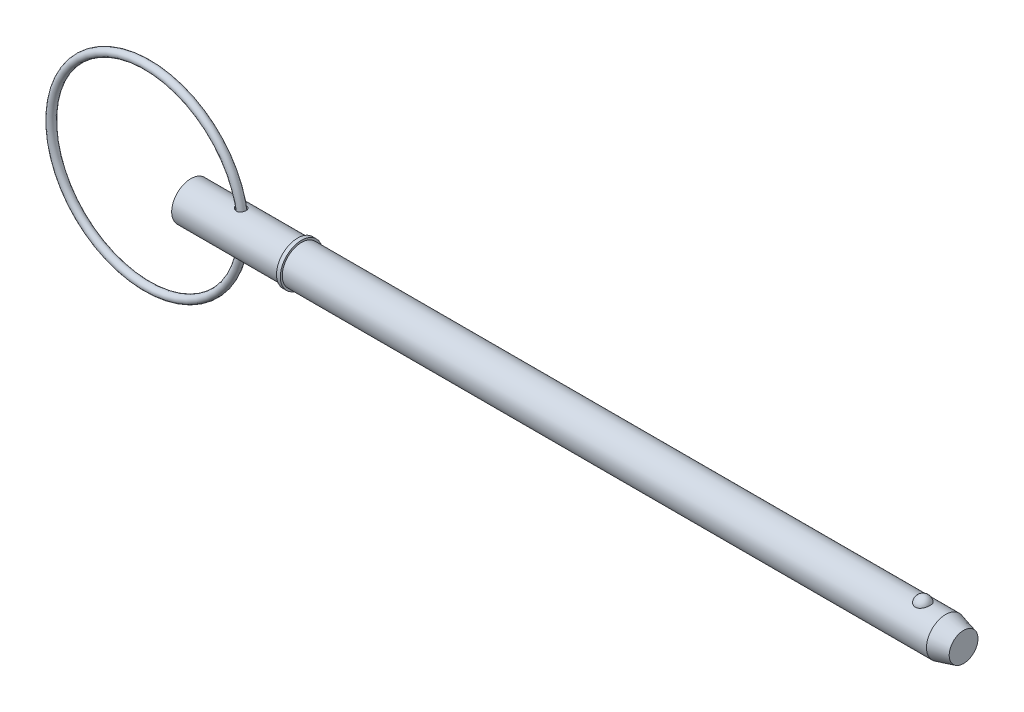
ISO-10303-21;
HEADER;
FILE_DESCRIPTION(('STEP AP214'),'2;1');
FILE_NAME('part.step','',(''),(''),'','','');
FILE_SCHEMA(('AUTOMOTIVE_DESIGN { 1 0 10303 214 1 1 1 1 }'));
ENDSEC;
DATA;
#1=APPLICATION_CONTEXT('core data for automotive mechanical design processes');
#2=APPLICATION_PROTOCOL_DEFINITION('international standard','automotive_design',2000,#1);
#3=PRODUCT_CONTEXT('',#1,'mechanical');
#4=PRODUCT('Part','Part','',(#3));
#5=PRODUCT_RELATED_PRODUCT_CATEGORY('part','',(#4));
#6=PRODUCT_DEFINITION_FORMATION('','',#4);
#7=PRODUCT_DEFINITION_CONTEXT('part definition',#1,'design');
#8=PRODUCT_DEFINITION('design','',#6,#7);
#9=PRODUCT_DEFINITION_SHAPE('','',#8);
#10=(LENGTH_UNIT() NAMED_UNIT(*) SI_UNIT(.MILLI.,.METRE.));
#11=(NAMED_UNIT(*) PLANE_ANGLE_UNIT() SI_UNIT($,.RADIAN.));
#12=(NAMED_UNIT(*) SI_UNIT($,.STERADIAN.) SOLID_ANGLE_UNIT());
#13=UNCERTAINTY_MEASURE_WITH_UNIT(LENGTH_MEASURE(1.E-05),#10,'distance_accuracy_value','');
#14=(GEOMETRIC_REPRESENTATION_CONTEXT(3) GLOBAL_UNCERTAINTY_ASSIGNED_CONTEXT((#13)) GLOBAL_UNIT_ASSIGNED_CONTEXT((#10,
#11,#12)) REPRESENTATION_CONTEXT('',''));
#15=CARTESIAN_POINT('',(0.,0.,0.));
#16=DIRECTION('',(0.,0.,1.));
#17=DIRECTION('',(1.,0.,0.));
#18=AXIS2_PLACEMENT_3D('',#15,#16,#17);
#19=CARTESIAN_POINT('',(-7.21857545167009,0.,0.));
#20=DIRECTION('',(0.,0.,1.));
#21=DIRECTION('',(1.,0.,0.));
#22=AXIS2_PLACEMENT_3D('',#19,#20,#21);
#23=TOROIDAL_SURFACE('',#22,15.875,0.634999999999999);
#24=CARTESIAN_POINT('',(9.29142454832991,0.,0.));
#25=VERTEX_POINT('',#24);
#26=VERTEX_LOOP('',#25);
#27=FACE_BOUND('',#26,.T.);
#28=ADVANCED_FACE('P0_F12',(#27),#23,.T.);
#29=CLOSED_SHELL('',(#28));
#30=MANIFOLD_SOLID_BREP('P0_B1',#29);
#31=CARTESIAN_POINT('',(0.,0.,0.));
#32=DIRECTION('',(1.,0.,0.));
#33=DIRECTION('',(0.,0.,-1.));
#34=AXIS2_PLACEMENT_3D('',#31,#32,#33);
#35=CYLINDRICAL_SURFACE('',#34,3.175);
#36=CARTESIAN_POINT('',(7.68750254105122,3.14043953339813,-0.467187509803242));
#37=CARTESIAN_POINT('',(7.71663570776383,3.13485007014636,-0.504758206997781));
#38=CARTESIAN_POINT('',(7.74907441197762,3.12895198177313,-0.539757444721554));
#39=CARTESIAN_POINT('',(7.81944011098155,3.11722901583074,-0.603799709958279));
#40=CARTESIAN_POINT('',(7.85737550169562,3.11140426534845,-0.632833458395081));
#41=CARTESIAN_POINT('',(7.93756775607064,3.10051072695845,-0.684213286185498));
#42=CARTESIAN_POINT('',(7.97981919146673,3.09544100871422,-0.706567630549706));
#43=CARTESIAN_POINT('',(8.06754397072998,3.08665483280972,-0.744015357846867));
#44=CARTESIAN_POINT('',(8.11301598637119,3.08293782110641,-0.759111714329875));
#45=CARTESIAN_POINT('',(8.20614871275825,3.07732974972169,-0.781538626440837));
#46=CARTESIAN_POINT('',(8.25381727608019,3.07544587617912,-0.788838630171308));
#47=CARTESIAN_POINT('',(8.34973955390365,3.07382984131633,-0.795114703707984));
#48=CARTESIAN_POINT('',(8.39799308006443,3.07409700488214,-0.794093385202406));
#49=CARTESIAN_POINT('',(8.4909727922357,3.07673252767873,-0.783815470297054));
#50=CARTESIAN_POINT('',(8.53575064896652,3.07898913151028,-0.774996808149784));
#51=CARTESIAN_POINT('',(8.62301664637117,3.08521060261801,-0.749844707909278));
#52=CARTESIAN_POINT('',(8.66550527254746,3.08917510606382,-0.733512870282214));
#53=CARTESIAN_POINT('',(8.74528857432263,3.09816330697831,-0.694543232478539));
#54=CARTESIAN_POINT('',(8.78272109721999,3.10313973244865,-0.672175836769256));
#55=CARTESIAN_POINT('',(8.85323831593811,3.11368155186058,-0.621513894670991));
#56=CARTESIAN_POINT('',(8.88632295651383,3.1192469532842,-0.59321927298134));
#57=CARTESIAN_POINT('',(8.94738786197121,3.13037258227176,-0.531394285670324));
#58=CARTESIAN_POINT('',(8.97535151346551,3.13593273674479,-0.497847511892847));
#59=CARTESIAN_POINT('',(9.02535984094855,3.14642822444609,-0.426512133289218));
#60=CARTESIAN_POINT('',(9.04740412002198,3.1513635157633,-0.388723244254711));
#61=CARTESIAN_POINT('',(9.08531615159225,3.16014674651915,-0.309373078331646));
#62=CARTESIAN_POINT('',(9.10109111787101,3.16397813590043,-0.267765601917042));
#63=CARTESIAN_POINT('',(9.12562372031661,3.17004373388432,-0.182419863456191));
#64=CARTESIAN_POINT('',(9.13438129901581,3.17227792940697,-0.138681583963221));
#65=CARTESIAN_POINT('',(9.14467797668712,3.17491257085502,-0.0501907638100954));
#66=CARTESIAN_POINT('',(9.14619790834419,3.17530814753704,-0.00543584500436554));
#67=CARTESIAN_POINT('',(9.14192925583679,3.17420952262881,0.0837005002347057));
#68=CARTESIAN_POINT('',(9.13614065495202,3.17271531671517,0.128081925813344));
#69=CARTESIAN_POINT('',(9.11741184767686,3.16800183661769,0.215146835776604));
#70=CARTESIAN_POINT('',(9.1044818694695,3.1647850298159,0.257832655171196));
#71=CARTESIAN_POINT('',(9.07179341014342,3.15697516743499,0.340371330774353));
#72=CARTESIAN_POINT('',(9.05203467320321,3.15238206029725,0.380224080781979));
#73=CARTESIAN_POINT('',(9.00612949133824,3.14231078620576,0.456042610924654));
#74=CARTESIAN_POINT('',(8.97997137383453,3.13683100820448,0.492001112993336));
#75=CARTESIAN_POINT('',(8.92194141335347,3.12560179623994,0.558920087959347));
#76=CARTESIAN_POINT('',(8.89006980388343,3.11985237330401,0.589880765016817));
#77=CARTESIAN_POINT('',(8.82164045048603,3.10876807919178,0.645751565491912));
#78=CARTESIAN_POINT('',(8.78510991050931,3.1034310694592,0.670694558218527));
#79=CARTESIAN_POINT('',(8.70823767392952,3.09374754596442,0.714035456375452));
#80=CARTESIAN_POINT('',(8.66789657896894,3.08940087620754,0.732434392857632));
#81=CARTESIAN_POINT('',(8.58520620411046,3.08224677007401,0.761976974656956));
#82=CARTESIAN_POINT('',(8.54289637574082,3.07941711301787,0.773225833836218));
#83=CARTESIAN_POINT('',(8.45693772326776,3.07549224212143,0.788693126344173));
#84=CARTESIAN_POINT('',(8.41328889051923,3.07439703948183,0.792911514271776));
#85=CARTESIAN_POINT('',(8.32565716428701,3.07402154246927,0.79436569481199));
#86=CARTESIAN_POINT('',(8.2816736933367,3.07475037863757,0.791566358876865));
#87=CARTESIAN_POINT('',(8.19474198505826,3.0779150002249,0.779168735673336));
#88=CARTESIAN_POINT('',(8.15179398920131,3.0803511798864,0.769568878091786));
#89=CARTESIAN_POINT('',(8.06605600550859,3.08678050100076,0.743371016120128));
#90=CARTESIAN_POINT('',(8.02336243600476,3.09083954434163,0.726473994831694));
#91=CARTESIAN_POINT('',(7.94127890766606,3.10003371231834,0.686178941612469));
#92=CARTESIAN_POINT('',(7.90189016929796,3.10516923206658,0.662778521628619));
#93=CARTESIAN_POINT('',(7.82556689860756,3.11622820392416,0.608722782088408));
#94=CARTESIAN_POINT('',(7.78884764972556,3.12217795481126,0.577767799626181));
#95=CARTESIAN_POINT('',(7.7212485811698,3.13396160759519,0.509990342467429));
#96=CARTESIAN_POINT('',(7.69036894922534,3.13979550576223,0.473167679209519));
#97=CARTESIAN_POINT('',(7.63604128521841,3.15055792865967,0.395137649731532));
#98=CARTESIAN_POINT('',(7.61248286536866,3.15549937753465,0.354009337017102));
#99=CARTESIAN_POINT('',(7.57323986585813,3.16396081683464,0.268021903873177));
#100=CARTESIAN_POINT('',(7.55754910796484,3.16748192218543,0.223165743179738));
#101=CARTESIAN_POINT('',(7.53586686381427,3.17240393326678,0.135111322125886));
#102=CARTESIAN_POINT('',(7.52916366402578,3.17395975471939,0.0920967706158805));
#103=CARTESIAN_POINT('',(7.52342449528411,3.1752897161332,0.00553088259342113));
#104=CARTESIAN_POINT('',(7.52438648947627,3.17506432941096,-0.0380203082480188));
#105=CARTESIAN_POINT('',(7.53361123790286,3.17293298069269,-0.121469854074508));
#106=CARTESIAN_POINT('',(7.54140526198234,3.17113493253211,-0.161424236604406));
#107=CARTESIAN_POINT('',(7.56329403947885,3.16619862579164,-0.239454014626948));
#108=CARTESIAN_POINT('',(7.57738500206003,3.16306117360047,-0.277530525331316));
#109=CARTESIAN_POINT('',(7.60689714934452,3.15670852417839,-0.341419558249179));
#110=CARTESIAN_POINT('',(7.62103486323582,3.15372268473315,-0.367859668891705));
#111=CARTESIAN_POINT('',(7.65218035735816,3.14734507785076,-0.418934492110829));
#112=CARTESIAN_POINT('',(7.66918829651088,3.14395328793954,-0.443569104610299));
#113=CARTESIAN_POINT('',(7.68750254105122,3.14043953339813,-0.467187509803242));
#114=B_SPLINE_CURVE_WITH_KNOTS('',3,(#36,#37,#38,#39,#40,#41,#42,#43,#44,#45,#46,#47,#48,#49,
#50,#51,#52,#53,#54,#55,#56,#57,#58,#59,#60,#61,#62,#63,#64,#65,#66,#67,#68,#69,#70,#71,#72,#73,
#74,#75,#76,#77,#78,#79,#80,#81,#82,#83,#84,#85,#86,#87,#88,#89,#90,#91,#92,#93,#94,#95,#96,#97,
#98,#99,#100,#101,#102,#103,#104,#105,#106,#107,#108,#109,#110,#111,#112,#113),.UNSPECIFIED.,
.T.,.F.,(4,2,2,2,2,2,2,2,2,2,2,2,2,2,2,2,2,2,2,2,2,2,2,2,2,2,2,2,2,2,2,2,2,2,2,2,2,2,4),(0.,
0.143496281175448,0.287214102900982,0.430753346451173,0.574233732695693,0.71827434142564,
0.862269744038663,0.998657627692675,1.13501647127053,1.26606395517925,1.39711310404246,
1.52858014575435,1.66005600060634,1.79341107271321,1.92676723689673,2.06047636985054,
2.19418580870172,2.32770423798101,2.46122766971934,2.59499649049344,2.72875984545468,
2.86177513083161,2.99476944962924,3.12575845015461,3.25674829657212,3.38839514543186,
3.5200724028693,3.65775119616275,3.79548061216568,3.93996868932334,4.08446141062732,
4.22665598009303,4.36873871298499,4.49873145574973,4.62868965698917,4.7503735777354,
4.87198434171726,4.96218670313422,5.05239406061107),.UNSPECIFIED.);
#115=CARTESIAN_POINT('',(7.68750254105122,3.14043953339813,-0.467187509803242));
#116=VERTEX_POINT('',#115);
#117=EDGE_CURVE('P1_E42',#116,#116,#114,.T.);
#118=ORIENTED_EDGE('',*,*,#117,.T.);
#119=EDGE_LOOP('',(#118));
#120=FACE_BOUND('',#119,.T.);
#121=CARTESIAN_POINT('',(0.,0.,0.));
#122=DIRECTION('',(1.,0.,0.));
#123=DIRECTION('',(0.,0.,-1.));
#124=AXIS2_PLACEMENT_3D('',#121,#122,#123);
#125=CIRCLE('',#124,3.175);
#126=CARTESIAN_POINT('',(0.,0.,-3.175));
#127=VERTEX_POINT('',#126);
#128=EDGE_CURVE('P1_E9',#127,#127,#125,.T.);
#129=ORIENTED_EDGE('',*,*,#128,.T.);
#130=EDGE_LOOP('',(#129));
#131=FACE_BOUND('',#130,.T.);
#132=CARTESIAN_POINT('',(17.655,0.,0.));
#133=DIRECTION('',(1.,0.,0.));
#134=DIRECTION('',(0.,0.,-1.));
#135=AXIS2_PLACEMENT_3D('',#132,#133,#134);
#136=CIRCLE('',#135,3.175);
#137=CARTESIAN_POINT('',(17.655,0.,-3.175));
#138=VERTEX_POINT('',#137);
#139=EDGE_CURVE('P1_E25',#138,#138,#136,.T.);
#140=ORIENTED_EDGE('',*,*,#139,.F.);
#141=EDGE_LOOP('',(#140));
#142=FACE_BOUND('',#141,.T.);
#143=CARTESIAN_POINT('',(7.68750254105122,-3.14043953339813,-0.467187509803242));
#144=CARTESIAN_POINT('',(7.66134108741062,-3.14545876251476,-0.433446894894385));
#145=CARTESIAN_POINT('',(7.63782862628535,-3.15023199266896,-0.397612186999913));
#146=CARTESIAN_POINT('',(7.59691922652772,-3.15880505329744,-0.322493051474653));
#147=CARTESIAN_POINT('',(7.57952031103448,-3.16260519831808,-0.283209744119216));
#148=CARTESIAN_POINT('',(7.55152687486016,-3.16882833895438,-0.202021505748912));
#149=CARTESIAN_POINT('',(7.54095517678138,-3.17124671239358,-0.160108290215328));
#150=CARTESIAN_POINT('',(7.52724513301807,-3.1743985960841,-0.0750206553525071));
#151=CARTESIAN_POINT('',(7.52410469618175,-3.17513258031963,-0.031846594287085));
#152=CARTESIAN_POINT('',(7.5253875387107,-3.17483506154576,0.0522260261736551));
#153=CARTESIAN_POINT('',(7.52944265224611,-3.17388949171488,0.0931310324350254));
#154=CARTESIAN_POINT('',(7.54421042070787,-3.17050389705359,0.1736507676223));
#155=CARTESIAN_POINT('',(7.5549232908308,-3.16806382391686,0.213265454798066));
#156=CARTESIAN_POINT('',(7.58252065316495,-3.16195002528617,0.290147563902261));
#157=CARTESIAN_POINT('',(7.59940259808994,-3.15827680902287,0.32741594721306));
#158=CARTESIAN_POINT('',(7.63869293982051,-3.15005936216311,0.398803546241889));
#159=CARTESIAN_POINT('',(7.66110286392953,-3.14551489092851,0.432921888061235));
#160=CARTESIAN_POINT('',(7.71258278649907,-3.13561737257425,0.49975352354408));
#161=CARTESIAN_POINT('',(7.74202268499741,-3.13022938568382,0.532176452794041));
#162=CARTESIAN_POINT('',(7.80559890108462,-3.11946135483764,0.592041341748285));
#163=CARTESIAN_POINT('',(7.83973728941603,-3.11408131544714,0.619481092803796));
#164=CARTESIAN_POINT('',(7.91474520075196,-3.10344314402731,0.670826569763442));
#165=CARTESIAN_POINT('',(7.95593439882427,-3.09822894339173,0.694276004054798));
#166=CARTESIAN_POINT('',(8.04171965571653,-3.08902387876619,0.734150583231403));
#167=CARTESIAN_POINT('',(8.08631621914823,-3.08503319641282,0.750574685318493));
#168=CARTESIAN_POINT('',(8.17840269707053,-3.07873340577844,0.776016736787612));
#169=CARTESIAN_POINT('',(8.22592511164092,-3.07644943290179,0.784924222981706));
#170=CARTESIAN_POINT('',(8.3218479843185,-3.07400734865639,0.79443684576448));
#171=CARTESIAN_POINT('',(8.37024809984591,-3.07384842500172,0.79504515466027));
#172=CARTESIAN_POINT('',(8.46394967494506,-3.07568838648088,0.787894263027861));
#173=CARTESIAN_POINT('',(8.50928504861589,-3.07757975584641,0.78055200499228));
#174=CARTESIAN_POINT('',(8.5979121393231,-3.0831587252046,0.758214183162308));
#175=CARTESIAN_POINT('',(8.6412043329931,-3.08684590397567,0.743220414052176));
#176=CARTESIAN_POINT('',(8.72259527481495,-3.09539071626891,0.706762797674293));
#177=CARTESIAN_POINT('',(8.7608371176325,-3.10019138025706,0.685603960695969));
#178=CARTESIAN_POINT('',(8.83314563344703,-3.11049979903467,0.637201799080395));
#179=CARTESIAN_POINT('',(8.86721230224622,-3.11600755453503,0.609958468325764));
#180=CARTESIAN_POINT('',(8.93027727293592,-3.12712026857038,0.550151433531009));
#181=CARTESIAN_POINT('',(8.95927559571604,-3.13272522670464,0.517587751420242));
#182=CARTESIAN_POINT('',(9.01149093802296,-3.14342495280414,0.448041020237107));
#183=CARTESIAN_POINT('',(9.03470756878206,-3.14851968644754,0.411057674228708));
#184=CARTESIAN_POINT('',(9.07510046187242,-3.15772445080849,0.333109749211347));
#185=CARTESIAN_POINT('',(9.09218248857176,-3.16181883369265,0.292094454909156));
#186=CARTESIAN_POINT('',(9.11940464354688,-3.16848144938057,0.207703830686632));
#187=CARTESIAN_POINT('',(9.12954467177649,-3.17104966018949,0.164328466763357));
#188=CARTESIAN_POINT('',(9.14265964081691,-3.17439058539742,0.0762710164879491));
#189=CARTESIAN_POINT('',(9.14560734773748,-3.17515647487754,0.0315846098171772));
#190=CARTESIAN_POINT('',(9.14418482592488,-3.1747899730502,-0.0576634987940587));
#191=CARTESIAN_POINT('',(9.13981460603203,-3.17365758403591,-0.102225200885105));
#192=CARTESIAN_POINT('',(9.12387791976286,-3.1696201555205,-0.189883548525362));
#193=CARTESIAN_POINT('',(9.11232323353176,-3.16671801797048,-0.232982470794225));
#194=CARTESIAN_POINT('',(9.08231097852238,-3.15945654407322,-0.316576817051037));
#195=CARTESIAN_POINT('',(9.06385315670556,-3.15509715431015,-0.357072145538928));
#196=CARTESIAN_POINT('',(9.02044668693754,-3.14538636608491,-0.434386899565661));
#197=CARTESIAN_POINT('',(8.99548654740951,-3.14003321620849,-0.471199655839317));
#198=CARTESIAN_POINT('',(8.93971208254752,-3.12893289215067,-0.540019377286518));
#199=CARTESIAN_POINT('',(8.9088979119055,-3.12318572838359,-0.572026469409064));
#200=CARTESIAN_POINT('',(8.84235816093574,-3.11197156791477,-0.630185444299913));
#201=CARTESIAN_POINT('',(8.80665432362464,-3.10650347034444,-0.656361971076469));
#202=CARTESIAN_POINT('',(8.73121463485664,-3.09644726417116,-0.702277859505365));
#203=CARTESIAN_POINT('',(8.69147940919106,-3.0918590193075,-0.722018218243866));
#204=CARTESIAN_POINT('',(8.60974645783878,-3.08414607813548,-0.754281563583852));
#205=CARTESIAN_POINT('',(8.56779175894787,-3.08100040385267,-0.766908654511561));
#206=CARTESIAN_POINT('',(8.48229847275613,-3.07640651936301,-0.785135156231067));
#207=CARTESIAN_POINT('',(8.4387599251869,-3.07495826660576,-0.790734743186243));
#208=CARTESIAN_POINT('',(8.35126980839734,-3.07388240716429,-0.794906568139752));
#209=CARTESIAN_POINT('',(8.30731772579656,-3.07425748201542,-0.79346845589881));
#210=CARTESIAN_POINT('',(8.22022709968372,-3.07674606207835,-0.783761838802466));
#211=CARTESIAN_POINT('',(8.17708875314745,-3.07885998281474,-0.775491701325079));
#212=CARTESIAN_POINT('',(8.09089465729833,-3.08468414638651,-0.751997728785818));
#213=CARTESIAN_POINT('',(8.0479194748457,-3.08845808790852,-0.736494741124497));
#214=CARTESIAN_POINT('',(7.96504527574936,-3.09716853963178,-0.698957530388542));
#215=CARTESIAN_POINT('',(7.92514708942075,-3.10210536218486,-0.676921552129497));
#216=CARTESIAN_POINT('',(7.8492503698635,-3.11263013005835,-0.626751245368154));
#217=CARTESIAN_POINT('',(7.81326800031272,-3.11822059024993,-0.598592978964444));
#218=CARTESIAN_POINT('',(7.74635335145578,-3.12944726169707,-0.53681285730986));
#219=CARTESIAN_POINT('',(7.71541970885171,-3.13508346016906,-0.503192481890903));
#220=CARTESIAN_POINT('',(7.68750254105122,-3.14043953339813,-0.467187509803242));
#221=B_SPLINE_CURVE_WITH_KNOTS('',3,(#143,#144,#145,#146,#147,#148,#149,#150,#151,#152,#153,
#154,#155,#156,#157,#158,#159,#160,#161,#162,#163,#164,#165,#166,#167,#168,#169,#170,#171,#172,
#173,#174,#175,#176,#177,#178,#179,#180,#181,#182,#183,#184,#185,#186,#187,#188,#189,#190,#191,
#192,#193,#194,#195,#196,#197,#198,#199,#200,#201,#202,#203,#204,#205,#206,#207,#208,#209,#210,
#211,#212,#213,#214,#215,#216,#217,#218,#219,#220),.UNSPECIFIED.,.T.,.F.,(4,2,2,2,2,2,2,2,2,2,2,
2,2,2,2,2,2,2,2,2,2,2,2,2,2,2,2,2,2,2,2,2,2,2,2,2,2,2,4),(0.,0.128825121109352,
0.257608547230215,0.386820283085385,0.515995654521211,0.638750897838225,0.761510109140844,
0.884218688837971,1.00696120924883,1.13877828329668,1.27065363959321,1.41304496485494,
1.55545741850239,1.69992800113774,1.84434335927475,1.98153642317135,2.11869732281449,
2.24997668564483,2.38125618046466,2.51253513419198,2.64382291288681,2.77704892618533,
2.91027685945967,3.04400848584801,3.17773995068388,3.31125271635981,3.44477037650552,
3.5785256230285,3.71227733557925,3.84545251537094,3.97860705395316,4.10975853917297,
4.24090673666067,4.37224786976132,4.50362039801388,4.64054596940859,4.77750836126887,
4.91501622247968,5.05248689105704),.UNSPECIFIED.);
#222=CARTESIAN_POINT('',(7.68750254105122,-3.14043953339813,-0.467187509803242));
#223=VERTEX_POINT('',#222);
#224=EDGE_CURVE('P1_E17',#223,#223,#221,.T.);
#225=ORIENTED_EDGE('',*,*,#224,.T.);
#226=EDGE_LOOP('',(#225));
#227=FACE_BOUND('',#226,.T.);
#228=ADVANCED_FACE('P1_F13',(#120,#131,#142,#227),#35,.T.);
#229=CARTESIAN_POINT('',(0.,0.,0.));
#230=DIRECTION('',(1.,0.,0.));
#231=DIRECTION('',(0.,0.,-1.));
#232=AXIS2_PLACEMENT_3D('',#229,#230,#231);
#233=CYLINDRICAL_SURFACE('',#232,3.175);
#234=CARTESIAN_POINT('',(124.847684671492,0.,0.));
#235=DIRECTION('',(1.,0.,0.));
#236=DIRECTION('',(0.,0.,-1.));
#237=AXIS2_PLACEMENT_3D('',#234,#235,#236);
#238=CIRCLE('',#237,3.175);
#239=CARTESIAN_POINT('',(124.847684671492,0.,-3.175));
#240=VERTEX_POINT('',#239);
#241=EDGE_CURVE('P1_E99',#240,#240,#238,.T.);
#242=ORIENTED_EDGE('',*,*,#241,.F.);
#243=EDGE_LOOP('',(#242));
#244=FACE_BOUND('',#243,.T.);
#245=CARTESIAN_POINT('',(18.29,0.,0.));
#246=DIRECTION('',(1.,0.,0.));
#247=DIRECTION('',(0.,0.,-1.));
#248=AXIS2_PLACEMENT_3D('',#245,#246,#247);
#249=CIRCLE('',#248,3.175);
#250=CARTESIAN_POINT('',(18.29,0.,-3.175));
#251=VERTEX_POINT('',#250);
#252=EDGE_CURVE('P1_E96',#251,#251,#249,.T.);
#253=ORIENTED_EDGE('',*,*,#252,.T.);
#254=EDGE_LOOP('',(#253));
#255=FACE_BOUND('',#254,.T.);
#256=CARTESIAN_POINT('',(121.07572762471,2.92898950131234,1.22541646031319));
#257=CARTESIAN_POINT('',(121.012316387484,2.92899434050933,1.22541146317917));
#258=CARTESIAN_POINT('',(120.948797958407,2.93112688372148,1.22034641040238));
#259=CARTESIAN_POINT('',(120.823530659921,2.93942752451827,1.20020949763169));
#260=CARTESIAN_POINT('',(120.761786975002,2.94560639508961,1.18511092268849));
#261=CARTESIAN_POINT('',(120.642065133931,2.96127115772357,1.1454035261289));
#262=CARTESIAN_POINT('',(120.584077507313,2.97074831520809,1.1208198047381));
#263=CARTESIAN_POINT('',(120.473194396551,2.99197584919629,1.06285154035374));
#264=CARTESIAN_POINT('',(120.420296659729,3.0037252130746,1.02947091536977));
#265=CARTESIAN_POINT('',(120.319268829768,3.02865714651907,0.953674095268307));
#266=CARTESIAN_POINT('',(120.271324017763,3.04187163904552,0.911021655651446));
#267=CARTESIAN_POINT('',(120.183036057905,3.06808741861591,0.818400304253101));
#268=CARTESIAN_POINT('',(120.142695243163,3.08108863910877,0.768429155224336));
#269=CARTESIAN_POINT('',(120.068803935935,3.10614903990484,0.660064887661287));
#270=CARTESIAN_POINT('',(120.035633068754,3.11814104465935,0.601396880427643));
#271=CARTESIAN_POINT('',(119.979119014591,3.13926931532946,0.479026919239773));
#272=CARTESIAN_POINT('',(119.955776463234,3.14840539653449,0.415324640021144));
#273=CARTESIAN_POINT('',(119.919178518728,3.16298160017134,0.28388538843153));
#274=CARTESIAN_POINT('',(119.906040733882,3.16837855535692,0.216110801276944));
#275=CARTESIAN_POINT('',(119.890567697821,3.17475386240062,0.0791367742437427));
#276=CARTESIAN_POINT('',(119.888232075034,3.17573236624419,0.0099373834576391));
#277=CARTESIAN_POINT('',(119.894388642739,3.17318075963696,-0.127420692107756));
#278=CARTESIAN_POINT('',(119.902807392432,3.16968122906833,-0.195583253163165));
#279=CARTESIAN_POINT('',(119.930175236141,3.1585790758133,-0.329413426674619));
#280=CARTESIAN_POINT('',(119.949124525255,3.15097637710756,-0.395080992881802));
#281=CARTESIAN_POINT('',(119.997205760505,3.13242485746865,-0.522180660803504));
#282=CARTESIAN_POINT('',(120.026352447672,3.12147119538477,-0.583606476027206));
#283=CARTESIAN_POINT('',(120.094235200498,3.09734973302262,-0.700436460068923));
#284=CARTESIAN_POINT('',(120.132972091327,3.08418174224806,-0.755840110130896));
#285=CARTESIAN_POINT('',(120.219477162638,3.05694884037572,-0.859404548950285));
#286=CARTESIAN_POINT('',(120.267296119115,3.04287919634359,-0.907521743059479));
#287=CARTESIAN_POINT('',(120.370735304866,3.01548927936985,-0.994758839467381));
#288=CARTESIAN_POINT('',(120.426354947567,3.0021689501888,-1.03387941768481));
#289=CARTESIAN_POINT('',(120.542809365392,2.97810316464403,-1.10126594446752));
#290=CARTESIAN_POINT('',(120.603518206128,2.96731170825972,-1.12973256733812));
#291=CARTESIAN_POINT('',(120.729371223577,2.94928934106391,-1.17598467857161));
#292=CARTESIAN_POINT('',(120.794513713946,2.94205708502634,-1.19377420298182));
#293=CARTESIAN_POINT('',(120.923856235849,2.93233065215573,-1.2174638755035));
#294=CARTESIAN_POINT('',(120.987938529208,2.92961621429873,-1.22391763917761));
#295=CARTESIAN_POINT('',(121.116337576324,2.92855752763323,-1.22644976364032));
#296=CARTESIAN_POINT('',(121.180654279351,2.93021238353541,-1.22253024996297));
#297=CARTESIAN_POINT('',(121.305523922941,2.93756851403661,-1.20474140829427));
#298=CARTESIAN_POINT('',(121.366131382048,2.94313790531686,-1.1911962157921));
#299=CARTESIAN_POINT('',(121.484110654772,2.95756226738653,-1.15491492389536));
#300=CARTESIAN_POINT('',(121.541482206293,2.96641750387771,-1.13217808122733));
#301=CARTESIAN_POINT('',(121.652769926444,2.98669918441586,-1.07755083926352));
#302=CARTESIAN_POINT('',(121.706584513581,2.9981771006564,-1.04547308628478));
#303=CARTESIAN_POINT('',(121.808147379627,3.02240235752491,-0.973220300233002));
#304=CARTESIAN_POINT('',(121.855894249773,3.03514999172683,-0.93304339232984));
#305=CARTESIAN_POINT('',(121.946581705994,3.06131230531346,-0.843372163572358));
#306=CARTESIAN_POINT('',(121.989158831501,3.07472822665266,-0.793510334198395));
#307=CARTESIAN_POINT('',(122.065676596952,3.10021106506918,-0.687241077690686));
#308=CARTESIAN_POINT('',(122.099615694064,3.1122777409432,-0.630832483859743));
#309=CARTESIAN_POINT('',(122.159120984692,3.134208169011,-0.511059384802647));
#310=CARTESIAN_POINT('',(122.184389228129,3.14399040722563,-0.447531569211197));
#311=CARTESIAN_POINT('',(122.224511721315,3.15983820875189,-0.316827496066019));
#312=CARTESIAN_POINT('',(122.239365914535,3.16590375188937,-0.249651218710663));
#313=CARTESIAN_POINT('',(122.258358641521,3.17370076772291,-0.113549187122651));
#314=CARTESIAN_POINT('',(122.262496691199,3.17543204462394,-0.044623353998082));
#315=CARTESIAN_POINT('',(122.259969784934,3.17438372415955,0.0929938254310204));
#316=CARTESIAN_POINT('',(122.253305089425,3.17160423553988,0.161685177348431));
#317=CARTESIAN_POINT('',(122.229375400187,3.1618438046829,0.296502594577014));
#318=CARTESIAN_POINT('',(122.212167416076,3.15488546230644,0.362640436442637));
#319=CARTESIAN_POINT('',(122.167547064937,3.13748892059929,0.490896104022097));
#320=CARTESIAN_POINT('',(122.140133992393,3.12705048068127,0.553013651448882));
#321=CARTESIAN_POINT('',(122.075462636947,3.10369139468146,0.671876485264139));
#322=CARTESIAN_POINT('',(122.038146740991,3.0907563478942,0.728587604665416));
#323=CARTESIAN_POINT('',(121.954524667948,3.06381731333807,0.834653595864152));
#324=CARTESIAN_POINT('',(121.908218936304,3.04981337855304,0.884008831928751));
#325=CARTESIAN_POINT('',(121.807718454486,3.02230423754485,0.973916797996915));
#326=CARTESIAN_POINT('',(121.753535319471,3.00879833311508,1.01448227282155));
#327=CARTESIAN_POINT('',(121.638529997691,2.98383625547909,1.08571550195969));
#328=CARTESIAN_POINT('',(121.577705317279,2.97238085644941,1.11637952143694));
#329=CARTESIAN_POINT('',(121.453369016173,2.95329063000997,1.16592590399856));
#330=CARTESIAN_POINT('',(121.390023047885,2.94553738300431,1.1851790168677));
#331=CARTESIAN_POINT('',(121.26076644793,2.9342556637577,1.2128480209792));
#332=CARTESIAN_POINT('',(121.194864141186,2.93071450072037,1.22129647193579));
#333=CARTESIAN_POINT('',(121.111116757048,2.9291525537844,1.22502505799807));
#334=CARTESIAN_POINT('',(121.093426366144,2.9289881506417,1.22541785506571));
#335=CARTESIAN_POINT('',(121.07572762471,2.92898950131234,1.22541646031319));
#336=B_SPLINE_CURVE_WITH_KNOTS('',3,(#256,#257,#258,#259,#260,#261,#262,#263,#264,#265,#266,
#267,#268,#269,#270,#271,#272,#273,#274,#275,#276,#277,#278,#279,#280,#281,#282,#283,#284,#285,
#286,#287,#288,#289,#290,#291,#292,#293,#294,#295,#296,#297,#298,#299,#300,#301,#302,#303,#304,
#305,#306,#307,#308,#309,#310,#311,#312,#313,#314,#315,#316,#317,#318,#319,#320,#321,#322,#323,
#324,#325,#326,#327,#328,#329,#330,#331,#332,#333,#334,#335),.UNSPECIFIED.,.T.,.F.,(4,2,2,2,2,2,
2,2,2,2,2,2,2,2,2,2,2,2,2,2,2,2,2,2,2,2,2,2,2,2,2,2,2,2,2,2,2,2,2,4),(0.,0.19018620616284,
0.380880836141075,0.57107426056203,0.761183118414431,0.956866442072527,1.1526097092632,
1.35701770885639,1.56143892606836,1.76818248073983,1.9749189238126,2.18025109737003,
2.3855870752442,2.59122111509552,2.79687285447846,3.00371012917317,3.21053185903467,
3.41323429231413,3.6158600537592,3.80828192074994,4.00066436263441,4.18685798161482,
4.37306665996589,4.56330302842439,4.75358348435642,4.95345287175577,5.1533579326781,
5.3595700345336,5.56578325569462,5.77200579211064,5.97822335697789,6.18333558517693,
6.38846199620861,6.59480900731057,6.8011457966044,7.00718137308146,7.21329457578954,
7.41228022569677,7.61066481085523,7.6637477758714),.UNSPECIFIED.);
#337=CARTESIAN_POINT('',(121.07572762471,2.92898950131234,1.22541646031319));
#338=VERTEX_POINT('',#337);
#339=EDGE_CURVE('P1_E34',#338,#338,#336,.T.);
#340=ORIENTED_EDGE('',*,*,#339,.T.);
#341=EDGE_LOOP('',(#340));
#342=FACE_BOUND('',#341,.T.);
#343=ADVANCED_FACE('P1_F46',(#244,#255,#342),#233,.T.);
#344=CARTESIAN_POINT('',(0.,0.,0.));
#345=DIRECTION('',(-1.,0.,0.));
#346=DIRECTION('',(0.,0.,1.));
#347=AXIS2_PLACEMENT_3D('',#344,#345,#346);
#348=PLANE('',#347);
#349=ORIENTED_EDGE('',*,*,#128,.F.);
#350=EDGE_LOOP('',(#349));
#351=FACE_BOUND('',#350,.T.);
#352=ADVANCED_FACE('P1_F15',(#351),#348,.T.);
#353=CARTESIAN_POINT('',(17.655,3.175,0.));
#354=DIRECTION('',(-1.,0.,0.));
#355=DIRECTION('',(0.,0.,1.));
#356=AXIS2_PLACEMENT_3D('',#353,#354,#355);
#357=PLANE('',#356);
#358=ORIENTED_EDGE('',*,*,#139,.T.);
#359=EDGE_LOOP('',(#358));
#360=FACE_BOUND('',#359,.T.);
#361=CARTESIAN_POINT('',(17.655,0.,0.));
#362=DIRECTION('',(1.,0.,0.));
#363=DIRECTION('',(0.,0.,-1.));
#364=AXIS2_PLACEMENT_3D('',#361,#362,#363);
#365=CIRCLE('',#364,3.4925);
#366=CARTESIAN_POINT('',(17.655,0.,-3.4925));
#367=VERTEX_POINT('',#366);
#368=EDGE_CURVE('P1_E30',#367,#367,#365,.T.);
#369=ORIENTED_EDGE('',*,*,#368,.F.);
#370=EDGE_LOOP('',(#369));
#371=FACE_BOUND('',#370,.T.);
#372=ADVANCED_FACE('P1_F81',(#360,#371),#357,.T.);
#373=CARTESIAN_POINT('',(0.,0.,0.));
#374=DIRECTION('',(1.,0.,0.));
#375=DIRECTION('',(0.,0.,-1.));
#376=AXIS2_PLACEMENT_3D('',#373,#374,#375);
#377=CYLINDRICAL_SURFACE('',#376,3.4925);
#378=ORIENTED_EDGE('',*,*,#368,.T.);
#379=EDGE_LOOP('',(#378));
#380=FACE_BOUND('',#379,.T.);
#381=CARTESIAN_POINT('',(18.29,0.,0.));
#382=DIRECTION('',(1.,0.,0.));
#383=DIRECTION('',(0.,0.,-1.));
#384=AXIS2_PLACEMENT_3D('',#381,#382,#383);
#385=CIRCLE('',#384,3.4925);
#386=CARTESIAN_POINT('',(18.29,0.,-3.4925));
#387=VERTEX_POINT('',#386);
#388=EDGE_CURVE('P1_E95',#387,#387,#385,.T.);
#389=ORIENTED_EDGE('',*,*,#388,.F.);
#390=EDGE_LOOP('',(#389));
#391=FACE_BOUND('',#390,.T.);
#392=ADVANCED_FACE('P1_F68',(#380,#391),#377,.T.);
#393=CARTESIAN_POINT('',(18.29,3.4925,0.));
#394=DIRECTION('',(1.,0.,0.));
#395=DIRECTION('',(0.,0.,-1.));
#396=AXIS2_PLACEMENT_3D('',#393,#394,#395);
#397=PLANE('',#396);
#398=ORIENTED_EDGE('',*,*,#388,.T.);
#399=EDGE_LOOP('',(#398));
#400=FACE_BOUND('',#399,.T.);
#401=ORIENTED_EDGE('',*,*,#252,.F.);
#402=EDGE_LOOP('',(#401));
#403=FACE_BOUND('',#402,.T.);
#404=ADVANCED_FACE('P1_F62',(#400,#403),#397,.T.);
#405=CARTESIAN_POINT('',(127.81,0.,0.));
#406=DIRECTION('',(-1.,0.,0.));
#407=DIRECTION('',(0.,0.,1.));
#408=AXIS2_PLACEMENT_3D('',#405,#406,#407);
#409=CONICAL_SURFACE('',#408,2.38125000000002,0.261799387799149);
#410=ORIENTED_EDGE('',*,*,#241,.T.);
#411=EDGE_LOOP('',(#410));
#412=FACE_BOUND('',#411,.T.);
#413=CARTESIAN_POINT('',(127.81,0.,0.));
#414=DIRECTION('',(1.,0.,0.));
#415=DIRECTION('',(0.,0.,-1.));
#416=AXIS2_PLACEMENT_3D('',#413,#414,#415);
#417=CIRCLE('',#416,2.38125000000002);
#418=CARTESIAN_POINT('',(127.81,0.,-2.38125000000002));
#419=VERTEX_POINT('',#418);
#420=EDGE_CURVE('P1_E41',#419,#419,#417,.T.);
#421=ORIENTED_EDGE('',*,*,#420,.F.);
#422=EDGE_LOOP('',(#421));
#423=FACE_BOUND('',#422,.T.);
#424=ADVANCED_FACE('P1_F59',(#412,#423),#409,.T.);
#425=CARTESIAN_POINT('',(127.81,2.38125000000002,0.));
#426=DIRECTION('',(1.,0.,0.));
#427=DIRECTION('',(0.,0.,-1.));
#428=AXIS2_PLACEMENT_3D('',#425,#426,#427);
#429=PLANE('',#428);
#430=ORIENTED_EDGE('',*,*,#420,.T.);
#431=EDGE_LOOP('',(#430));
#432=FACE_BOUND('',#431,.T.);
#433=ADVANCED_FACE('P1_F55',(#432),#429,.T.);
#434=CARTESIAN_POINT('',(121.07572762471,2.8575,0.));
#435=DIRECTION('',(-1.,0.,0.));
#436=DIRECTION('',(0.,1.,0.));
#437=AXIS2_PLACEMENT_3D('',#434,#435,#436);
#438=SPHERICAL_SURFACE('',#437,1.22749999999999);
#439=ORIENTED_EDGE('',*,*,#339,.F.);
#440=EDGE_LOOP('',(#439));
#441=FACE_BOUND('',#440,.T.);
#442=ADVANCED_FACE('P1_F50',(#441),#438,.T.);
#443=CARTESIAN_POINT('',(-7.21857545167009,0.,0.));
#444=DIRECTION('',(0.,0.,1.));
#445=DIRECTION('',(1.,0.,0.));
#446=AXIS2_PLACEMENT_3D('',#443,#444,#445);
#447=TOROIDAL_SURFACE('',#446,15.875,0.793749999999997);
#448=ORIENTED_EDGE('',*,*,#224,.F.);
#449=EDGE_LOOP('',(#448));
#450=FACE_BOUND('',#449,.T.);
#451=ORIENTED_EDGE('',*,*,#117,.F.);
#452=EDGE_LOOP('',(#451));
#453=FACE_BOUND('',#452,.T.);
#454=ADVANCED_FACE('P1_F54',(#450,#453),#447,.F.);
#455=CLOSED_SHELL('',(#228,#343,#352,#372,#392,#404,#424,#433,#442,#454));
#456=MANIFOLD_SOLID_BREP('P1_B1',#455);
#457=ADVANCED_BREP_SHAPE_REPRESENTATION('',(#18,#30,#456),#14);
#458=SHAPE_DEFINITION_REPRESENTATION(#9,#457);
ENDSEC;
END-ISO-10303-21;
